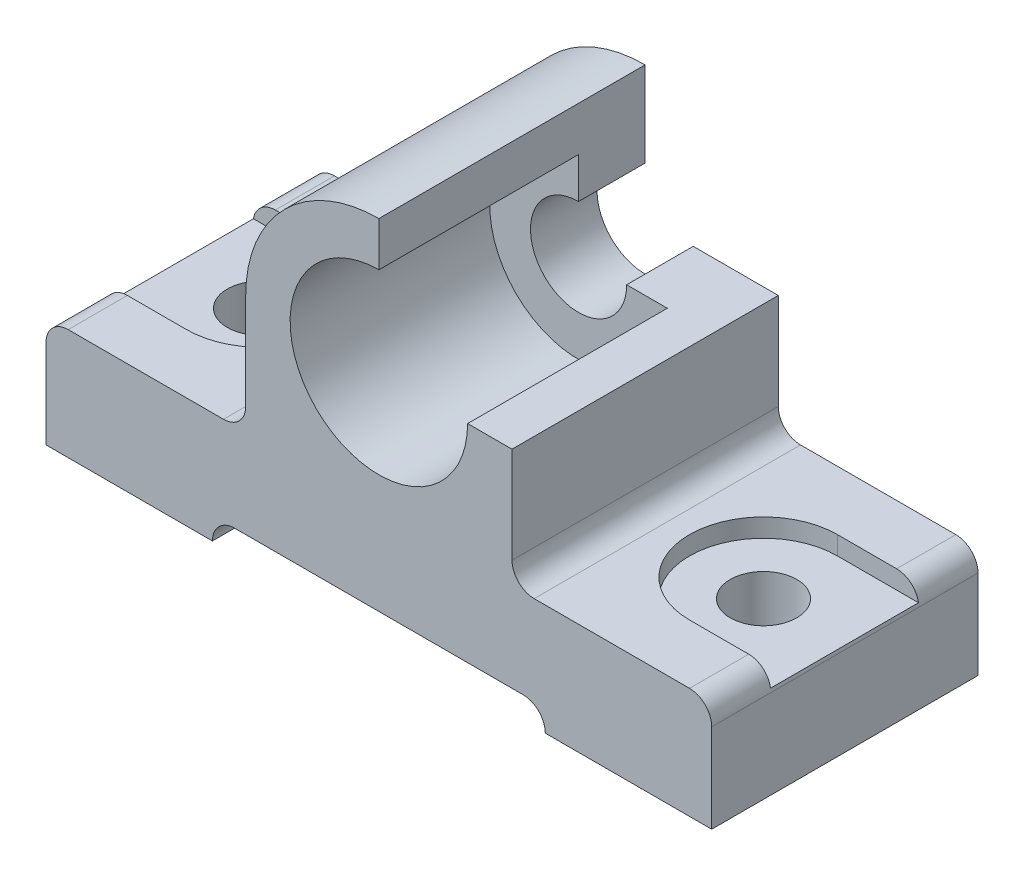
ISO-10303-21;
HEADER;
FILE_DESCRIPTION(('STEP AP214'),'2;1');
FILE_NAME('part.step','',(''),(''),'','','');
FILE_SCHEMA(('AUTOMOTIVE_DESIGN { 1 0 10303 214 1 1 1 1 }'));
ENDSEC;
DATA;
#1=APPLICATION_CONTEXT('core data for automotive mechanical design processes');
#2=APPLICATION_PROTOCOL_DEFINITION('international standard','automotive_design',2000,#1);
#3=PRODUCT_CONTEXT('',#1,'mechanical');
#4=PRODUCT('Part','Part','',(#3));
#5=PRODUCT_RELATED_PRODUCT_CATEGORY('part','',(#4));
#6=PRODUCT_DEFINITION_FORMATION('','',#4);
#7=PRODUCT_DEFINITION_CONTEXT('part definition',#1,'design');
#8=PRODUCT_DEFINITION('design','',#6,#7);
#9=PRODUCT_DEFINITION_SHAPE('','',#8);
#10=(LENGTH_UNIT() NAMED_UNIT(*) SI_UNIT(.MILLI.,.METRE.));
#11=(NAMED_UNIT(*) PLANE_ANGLE_UNIT() SI_UNIT($,.RADIAN.));
#12=(NAMED_UNIT(*) SI_UNIT($,.STERADIAN.) SOLID_ANGLE_UNIT());
#13=UNCERTAINTY_MEASURE_WITH_UNIT(LENGTH_MEASURE(1.E-05),#10,'distance_accuracy_value','');
#14=(GEOMETRIC_REPRESENTATION_CONTEXT(3) GLOBAL_UNCERTAINTY_ASSIGNED_CONTEXT((#13)) GLOBAL_UNIT_ASSIGNED_CONTEXT((#10,
#11,#12)) REPRESENTATION_CONTEXT('',''));
#15=CARTESIAN_POINT('',(0.,0.,0.));
#16=DIRECTION('',(0.,0.,1.));
#17=DIRECTION('',(1.,0.,0.));
#18=AXIS2_PLACEMENT_3D('',#15,#16,#17);
#19=CARTESIAN_POINT('',(0.,0.,-36.));
#20=DIRECTION('',(0.,-1.,0.));
#21=DIRECTION('',(0.,0.,-1.));
#22=AXIS2_PLACEMENT_3D('',#19,#20,#21);
#23=PLANE('',#22);
#24=DIRECTION('',(1.,0.,0.));
#25=VECTOR('',#24,1.);
#26=CARTESIAN_POINT('',(0.,0.,0.));
#27=LINE('',#26,#25);
#28=CARTESIAN_POINT('',(0.,0.,0.));
#29=VERTEX_POINT('',#28);
#30=CARTESIAN_POINT('',(22.5,0.,0.));
#31=VERTEX_POINT('',#30);
#32=EDGE_CURVE('E355',#29,#31,#27,.T.);
#33=ORIENTED_EDGE('',*,*,#32,.F.);
#34=DIRECTION('',(0.,0.,1.));
#35=VECTOR('',#34,1.);
#36=CARTESIAN_POINT('',(0.,0.,-36.));
#37=LINE('',#36,#35);
#38=CARTESIAN_POINT('',(0.,0.,-36.));
#39=VERTEX_POINT('',#38);
#40=EDGE_CURVE('E250',#39,#29,#37,.T.);
#41=ORIENTED_EDGE('',*,*,#40,.F.);
#42=DIRECTION('',(1.,0.,0.));
#43=VECTOR('',#42,1.);
#44=CARTESIAN_POINT('',(0.,0.,-36.));
#45=LINE('',#44,#43);
#46=CARTESIAN_POINT('',(22.5,0.,-36.));
#47=VERTEX_POINT('',#46);
#48=EDGE_CURVE('E382',#39,#47,#45,.T.);
#49=ORIENTED_EDGE('',*,*,#48,.T.);
#50=DIRECTION('',(0.,0.,1.));
#51=VECTOR('',#50,1.);
#52=CARTESIAN_POINT('',(22.5,0.,-36.));
#53=LINE('',#52,#51);
#54=EDGE_CURVE('E262',#47,#31,#53,.T.);
#55=ORIENTED_EDGE('',*,*,#54,.T.);
#56=EDGE_LOOP('',(#33,#41,#49,#55));
#57=FACE_BOUND('',#56,.T.);
#58=CARTESIAN_POINT('',(11.,0.,-18.));
#59=DIRECTION('',(0.,-1.,0.));
#60=DIRECTION('',(0.,0.,-1.));
#61=AXIS2_PLACEMENT_3D('',#58,#59,#60);
#62=CIRCLE('',#61,4.5);
#63=CARTESIAN_POINT('',(11.,0.,-22.5));
#64=VERTEX_POINT('',#63);
#65=EDGE_CURVE('E430',#64,#64,#62,.T.);
#66=ORIENTED_EDGE('',*,*,#65,.F.);
#67=EDGE_LOOP('',(#66));
#68=FACE_BOUND('',#67,.T.);
#69=ADVANCED_FACE('F26',(#57,#68),#23,.T.);
#70=CARTESIAN_POINT('',(11.,12.5,-18.));
#71=DIRECTION('',(0.,1.,0.));
#72=DIRECTION('',(0.,0.,1.));
#73=AXIS2_PLACEMENT_3D('',#70,#71,#72);
#74=PLANE('',#73);
#75=DIRECTION('',(-1.,0.,0.));
#76=VECTOR('',#75,1.);
#77=CARTESIAN_POINT('',(0.,12.5,-8.));
#78=LINE('',#77,#76);
#79=CARTESIAN_POINT('',(11.,12.5,-8.));
#80=VERTEX_POINT('',#79);
#81=CARTESIAN_POINT('',(0.0419601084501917,12.5,-8.));
#82=VERTEX_POINT('',#81);
#83=EDGE_CURVE('E442',#80,#82,#78,.T.);
#84=ORIENTED_EDGE('',*,*,#83,.F.);
#85=CARTESIAN_POINT('',(11.,12.5,-18.));
#86=DIRECTION('',(0.,-1.,0.));
#87=DIRECTION('',(0.,0.,1.));
#88=AXIS2_PLACEMENT_3D('',#85,#86,#87);
#89=CIRCLE('',#88,10.);
#90=CARTESIAN_POINT('',(11.,12.5,-28.));
#91=VERTEX_POINT('',#90);
#92=EDGE_CURVE('E445',#91,#80,#89,.T.);
#93=ORIENTED_EDGE('',*,*,#92,.F.);
#94=DIRECTION('',(1.,0.,0.));
#95=VECTOR('',#94,1.);
#96=CARTESIAN_POINT('',(0.,12.5,-28.));
#97=LINE('',#96,#95);
#98=CARTESIAN_POINT('',(0.0419601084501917,12.5,-28.));
#99=VERTEX_POINT('',#98);
#100=EDGE_CURVE('E447',#99,#91,#97,.T.);
#101=ORIENTED_EDGE('',*,*,#100,.F.);
#102=DIRECTION('',(0.,0.,1.));
#103=VECTOR('',#102,1.);
#104=CARTESIAN_POINT('',(0.0419601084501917,12.5,-36.));
#105=LINE('',#104,#103);
#106=EDGE_CURVE('E326',#82,#99,#105,.F.);
#107=ORIENTED_EDGE('',*,*,#106,.F.);
#108=EDGE_LOOP('',(#84,#93,#101,#107));
#109=FACE_BOUND('',#108,.T.);
#110=CARTESIAN_POINT('',(11.,12.5,-18.));
#111=DIRECTION('',(0.,-1.,0.));
#112=DIRECTION('',(0.,0.,1.));
#113=AXIS2_PLACEMENT_3D('',#110,#111,#112);
#114=CIRCLE('',#113,4.5);
#115=CARTESIAN_POINT('',(11.,12.5,-13.5));
#116=VERTEX_POINT('',#115);
#117=EDGE_CURVE('E232',#116,#116,#114,.T.);
#118=ORIENTED_EDGE('',*,*,#117,.T.);
#119=EDGE_LOOP('',(#118));
#120=FACE_BOUND('',#119,.T.);
#121=ADVANCED_FACE('F506',(#109,#120),#74,.T.);
#122=CARTESIAN_POINT('',(0.,15.,-36.));
#123=DIRECTION('',(0.,1.,0.));
#124=DIRECTION('',(0.,0.,1.));
#125=AXIS2_PLACEMENT_3D('',#122,#123,#124);
#126=PLANE('',#125);
#127=DIRECTION('',(0.,0.,1.));
#128=VECTOR('',#127,1.);
#129=CARTESIAN_POINT('',(3.,15.,-36.));
#130=LINE('',#129,#128);
#131=CARTESIAN_POINT('',(3.,15.,-36.));
#132=VERTEX_POINT('',#131);
#133=CARTESIAN_POINT('',(3.,15.,-28.));
#134=VERTEX_POINT('',#133);
#135=EDGE_CURVE('E290',#132,#134,#130,.T.);
#136=ORIENTED_EDGE('',*,*,#135,.T.);
#137=DIRECTION('',(1.,0.,0.));
#138=VECTOR('',#137,1.);
#139=CARTESIAN_POINT('',(0.,15.,-28.));
#140=LINE('',#139,#138);
#141=CARTESIAN_POINT('',(11.,15.,-28.));
#142=VERTEX_POINT('',#141);
#143=EDGE_CURVE('E439',#134,#142,#140,.T.);
#144=ORIENTED_EDGE('',*,*,#143,.T.);
#145=CARTESIAN_POINT('',(11.,15.,-18.));
#146=DIRECTION('',(0.,-1.,0.));
#147=DIRECTION('',(0.,0.,1.));
#148=AXIS2_PLACEMENT_3D('',#145,#146,#147);
#149=CIRCLE('',#148,10.);
#150=CARTESIAN_POINT('',(11.,15.,-8.));
#151=VERTEX_POINT('',#150);
#152=EDGE_CURVE('E436',#142,#151,#149,.T.);
#153=ORIENTED_EDGE('',*,*,#152,.T.);
#154=DIRECTION('',(-1.,0.,0.));
#155=VECTOR('',#154,1.);
#156=CARTESIAN_POINT('',(0.,15.,-8.));
#157=LINE('',#156,#155);
#158=CARTESIAN_POINT('',(3.,15.,-8.));
#159=VERTEX_POINT('',#158);
#160=EDGE_CURVE('E433',#151,#159,#157,.T.);
#161=ORIENTED_EDGE('',*,*,#160,.T.);
#162=CARTESIAN_POINT('',(3.,15.,0.));
#163=VERTEX_POINT('',#162);
#164=EDGE_CURVE('E289',#159,#163,#130,.T.);
#165=ORIENTED_EDGE('',*,*,#164,.T.);
#166=DIRECTION('',(-1.,0.,0.));
#167=VECTOR('',#166,1.);
#168=CARTESIAN_POINT('',(0.,15.,0.));
#169=LINE('',#168,#167);
#170=CARTESIAN_POINT('',(24.,15.,0.));
#171=VERTEX_POINT('',#170);
#172=EDGE_CURVE('E377',#171,#163,#169,.T.);
#173=ORIENTED_EDGE('',*,*,#172,.F.);
#174=DIRECTION('',(0.,0.,1.));
#175=VECTOR('',#174,1.);
#176=CARTESIAN_POINT('',(24.,15.,-36.));
#177=LINE('',#176,#175);
#178=CARTESIAN_POINT('',(24.,15.,-36.));
#179=VERTEX_POINT('',#178);
#180=EDGE_CURVE('E293',#171,#179,#177,.F.);
#181=ORIENTED_EDGE('',*,*,#180,.T.);
#182=DIRECTION('',(-1.,0.,0.));
#183=VECTOR('',#182,1.);
#184=CARTESIAN_POINT('',(0.,15.,-36.));
#185=LINE('',#184,#183);
#186=EDGE_CURVE('E241',#179,#132,#185,.T.);
#187=ORIENTED_EDGE('',*,*,#186,.T.);
#188=EDGE_LOOP('',(#136,#144,#153,#161,#165,#173,#181,#187));
#189=FACE_BOUND('',#188,.T.);
#190=ADVANCED_FACE('F512',(#189),#126,.T.);
#191=CARTESIAN_POINT('',(3.,12.,-36.));
#192=DIRECTION('',(0.,0.,1.));
#193=DIRECTION('',(1.,0.,0.));
#194=AXIS2_PLACEMENT_3D('',#191,#192,#193);
#195=CYLINDRICAL_SURFACE('',#194,3.);
#196=ORIENTED_EDGE('',*,*,#106,.T.);
#197=CARTESIAN_POINT('',(3.,12.,-28.));
#198=DIRECTION('',(0.,0.,1.));
#199=DIRECTION('',(1.,0.,0.));
#200=AXIS2_PLACEMENT_3D('',#197,#198,#199);
#201=CIRCLE('',#200,3.);
#202=EDGE_CURVE('E332',#99,#134,#201,.F.);
#203=ORIENTED_EDGE('',*,*,#202,.T.);
#204=ORIENTED_EDGE('',*,*,#135,.F.);
#205=CARTESIAN_POINT('',(3.,12.,-36.));
#206=DIRECTION('',(0.,0.,1.));
#207=DIRECTION('',(1.,0.,0.));
#208=AXIS2_PLACEMENT_3D('',#205,#206,#207);
#209=CIRCLE('',#208,3.);
#210=CARTESIAN_POINT('',(0.,12.,-36.));
#211=VERTEX_POINT('',#210);
#212=EDGE_CURVE('E280',#211,#132,#209,.F.);
#213=ORIENTED_EDGE('',*,*,#212,.F.);
#214=DIRECTION('',(0.,0.,1.));
#215=VECTOR('',#214,1.);
#216=CARTESIAN_POINT('',(0.,12.,-36.));
#217=LINE('',#216,#215);
#218=CARTESIAN_POINT('',(0.,12.,0.));
#219=VERTEX_POINT('',#218);
#220=EDGE_CURVE('E295',#219,#211,#217,.F.);
#221=ORIENTED_EDGE('',*,*,#220,.F.);
#222=CARTESIAN_POINT('',(3.,12.,0.));
#223=DIRECTION('',(0.,0.,1.));
#224=DIRECTION('',(1.,0.,0.));
#225=AXIS2_PLACEMENT_3D('',#222,#223,#224);
#226=CIRCLE('',#225,3.);
#227=EDGE_CURVE('E269',#163,#219,#226,.T.);
#228=ORIENTED_EDGE('',*,*,#227,.F.);
#229=ORIENTED_EDGE('',*,*,#164,.F.);
#230=CARTESIAN_POINT('',(3.,12.,-8.));
#231=DIRECTION('',(0.,0.,-1.));
#232=DIRECTION('',(-1.,0.,0.));
#233=AXIS2_PLACEMENT_3D('',#230,#231,#232);
#234=CIRCLE('',#233,3.);
#235=EDGE_CURVE('E329',#159,#82,#234,.F.);
#236=ORIENTED_EDGE('',*,*,#235,.T.);
#237=EDGE_LOOP('',(#196,#203,#204,#213,#221,#228,#229,#236));
#238=FACE_BOUND('',#237,.T.);
#239=ADVANCED_FACE('F541',(#238),#195,.T.);
#240=CARTESIAN_POINT('',(0.,0.,-36.));
#241=DIRECTION('',(-1.,0.,0.));
#242=DIRECTION('',(0.,0.,1.));
#243=AXIS2_PLACEMENT_3D('',#240,#241,#242);
#244=PLANE('',#243);
#245=DIRECTION('',(0.,-1.,0.));
#246=VECTOR('',#245,1.);
#247=CARTESIAN_POINT('',(0.,0.,0.));
#248=LINE('',#247,#246);
#249=EDGE_CURVE('E353',#219,#29,#248,.T.);
#250=ORIENTED_EDGE('',*,*,#249,.F.);
#251=ORIENTED_EDGE('',*,*,#220,.T.);
#252=DIRECTION('',(0.,-1.,0.));
#253=VECTOR('',#252,1.);
#254=CARTESIAN_POINT('',(0.,0.,-36.));
#255=LINE('',#254,#253);
#256=EDGE_CURVE('E380',#211,#39,#255,.T.);
#257=ORIENTED_EDGE('',*,*,#256,.T.);
#258=ORIENTED_EDGE('',*,*,#40,.T.);
#259=EDGE_LOOP('',(#250,#251,#257,#258));
#260=FACE_BOUND('',#259,.T.);
#261=ADVANCED_FACE('F28',(#260),#244,.T.);
#262=CARTESIAN_POINT('',(27.,15.,-36.));
#263=DIRECTION('',(-1.,0.,0.));
#264=DIRECTION('',(0.,0.,1.));
#265=AXIS2_PLACEMENT_3D('',#262,#263,#264);
#266=PLANE('',#265);
#267=DIRECTION('',(0.,-1.,0.));
#268=VECTOR('',#267,1.);
#269=CARTESIAN_POINT('',(27.,15.,-36.));
#270=LINE('',#269,#268);
#271=CARTESIAN_POINT('',(27.,31.,-36.));
#272=VERTEX_POINT('',#271);
#273=CARTESIAN_POINT('',(27.,18.,-36.));
#274=VERTEX_POINT('',#273);
#275=EDGE_CURVE('E238',#272,#274,#270,.T.);
#276=ORIENTED_EDGE('',*,*,#275,.T.);
#277=DIRECTION('',(0.,0.,1.));
#278=VECTOR('',#277,1.);
#279=CARTESIAN_POINT('',(27.,18.,0.));
#280=LINE('',#279,#278);
#281=CARTESIAN_POINT('',(27.,18.,0.));
#282=VERTEX_POINT('',#281);
#283=EDGE_CURVE('E286',#274,#282,#280,.T.);
#284=ORIENTED_EDGE('',*,*,#283,.T.);
#285=DIRECTION('',(0.,-1.,0.));
#286=VECTOR('',#285,1.);
#287=CARTESIAN_POINT('',(27.,15.,0.));
#288=LINE('',#287,#286);
#289=CARTESIAN_POINT('',(27.,31.,0.));
#290=VERTEX_POINT('',#289);
#291=EDGE_CURVE('E374',#290,#282,#288,.T.);
#292=ORIENTED_EDGE('',*,*,#291,.F.);
#293=DIRECTION('',(0.,0.,1.));
#294=VECTOR('',#293,1.);
#295=CARTESIAN_POINT('',(27.,31.,-36.));
#296=LINE('',#295,#294);
#297=EDGE_CURVE('E251',#272,#290,#296,.T.);
#298=ORIENTED_EDGE('',*,*,#297,.F.);
#299=EDGE_LOOP('',(#276,#284,#292,#298));
#300=FACE_BOUND('',#299,.T.);
#301=ADVANCED_FACE('F535',(#300),#266,.T.);
#302=CARTESIAN_POINT('',(45.,31.,-36.));
#303=DIRECTION('',(0.,0.,1.));
#304=DIRECTION('',(1.,0.,0.));
#305=AXIS2_PLACEMENT_3D('',#302,#303,#304);
#306=CYLINDRICAL_SURFACE('',#305,18.);
#307=DIRECTION('',(0.,0.,1.));
#308=VECTOR('',#307,1.);
#309=CARTESIAN_POINT('',(45.,49.,-36.));
#310=LINE('',#309,#308);
#311=CARTESIAN_POINT('',(45.,49.,-36.));
#312=VERTEX_POINT('',#311);
#313=CARTESIAN_POINT('',(45.,49.,0.));
#314=VERTEX_POINT('',#313);
#315=EDGE_CURVE('E217',#312,#314,#310,.T.);
#316=ORIENTED_EDGE('',*,*,#315,.F.);
#317=CARTESIAN_POINT('',(45.,31.,-36.));
#318=DIRECTION('',(0.,0.,1.));
#319=DIRECTION('',(1.,0.,0.));
#320=AXIS2_PLACEMENT_3D('',#317,#318,#319);
#321=CIRCLE('',#320,18.);
#322=EDGE_CURVE('E229',#312,#272,#321,.T.);
#323=ORIENTED_EDGE('',*,*,#322,.T.);
#324=ORIENTED_EDGE('',*,*,#297,.T.);
#325=CARTESIAN_POINT('',(45.,31.,0.));
#326=DIRECTION('',(0.,0.,1.));
#327=DIRECTION('',(1.,0.,0.));
#328=AXIS2_PLACEMENT_3D('',#325,#326,#327);
#329=CIRCLE('',#328,18.);
#330=EDGE_CURVE('E231',#314,#290,#329,.T.);
#331=ORIENTED_EDGE('',*,*,#330,.F.);
#332=EDGE_LOOP('',(#316,#323,#324,#331));
#333=FACE_BOUND('',#332,.T.);
#334=ADVANCED_FACE('F227',(#333),#306,.T.);
#335=CARTESIAN_POINT('',(63.,31.,-36.));
#336=DIRECTION('',(1.,0.,0.));
#337=DIRECTION('',(0.,0.,-1.));
#338=AXIS2_PLACEMENT_3D('',#335,#336,#337);
#339=PLANE('',#338);
#340=DIRECTION('',(0.,1.,0.));
#341=VECTOR('',#340,1.);
#342=CARTESIAN_POINT('',(63.,31.,0.));
#343=LINE('',#342,#341);
#344=CARTESIAN_POINT('',(63.,18.,0.));
#345=VERTEX_POINT('',#344);
#346=CARTESIAN_POINT('',(63.,31.,0.));
#347=VERTEX_POINT('',#346);
#348=EDGE_CURVE('E370',#345,#347,#343,.T.);
#349=ORIENTED_EDGE('',*,*,#348,.F.);
#350=DIRECTION('',(0.,0.,1.));
#351=VECTOR('',#350,1.);
#352=CARTESIAN_POINT('',(63.,18.,-36.));
#353=LINE('',#352,#351);
#354=CARTESIAN_POINT('',(63.,18.,-36.));
#355=VERTEX_POINT('',#354);
#356=EDGE_CURVE('E284',#345,#355,#353,.F.);
#357=ORIENTED_EDGE('',*,*,#356,.T.);
#358=DIRECTION('',(0.,1.,0.));
#359=VECTOR('',#358,1.);
#360=CARTESIAN_POINT('',(63.,31.,-36.));
#361=LINE('',#360,#359);
#362=CARTESIAN_POINT('',(63.,31.,-36.));
#363=VERTEX_POINT('',#362);
#364=EDGE_CURVE('E239',#355,#363,#361,.T.);
#365=ORIENTED_EDGE('',*,*,#364,.T.);
#366=DIRECTION('',(0.,0.,1.));
#367=VECTOR('',#366,1.);
#368=CARTESIAN_POINT('',(63.,31.,-36.));
#369=LINE('',#368,#367);
#370=EDGE_CURVE('E254',#363,#347,#369,.T.);
#371=ORIENTED_EDGE('',*,*,#370,.T.);
#372=EDGE_LOOP('',(#349,#357,#365,#371));
#373=FACE_BOUND('',#372,.T.);
#374=ADVANCED_FACE('F412',(#373),#339,.T.);
#375=CARTESIAN_POINT('',(63.,15.,-36.));
#376=DIRECTION('',(0.,1.,0.));
#377=DIRECTION('',(0.,0.,1.));
#378=AXIS2_PLACEMENT_3D('',#375,#376,#377);
#379=PLANE('',#378);
#380=DIRECTION('',(1.,0.,0.));
#381=VECTOR('',#380,1.);
#382=CARTESIAN_POINT('',(90.,15.,-8.));
#383=LINE('',#382,#381);
#384=CARTESIAN_POINT('',(79.,15.,-8.));
#385=VERTEX_POINT('',#384);
#386=CARTESIAN_POINT('',(87.,15.,-8.));
#387=VERTEX_POINT('',#386);
#388=EDGE_CURVE('E464',#385,#387,#383,.T.);
#389=ORIENTED_EDGE('',*,*,#388,.F.);
#390=CARTESIAN_POINT('',(79.,15.,-18.));
#391=DIRECTION('',(0.,1.,0.));
#392=DIRECTION('',(0.,0.,1.));
#393=AXIS2_PLACEMENT_3D('',#390,#391,#392);
#394=CIRCLE('',#393,10.);
#395=CARTESIAN_POINT('',(79.,15.,-28.));
#396=VERTEX_POINT('',#395);
#397=EDGE_CURVE('E461',#396,#385,#394,.T.);
#398=ORIENTED_EDGE('',*,*,#397,.F.);
#399=DIRECTION('',(-1.,0.,0.));
#400=VECTOR('',#399,1.);
#401=CARTESIAN_POINT('',(90.,15.,-28.));
#402=LINE('',#401,#400);
#403=CARTESIAN_POINT('',(87.,15.,-28.));
#404=VERTEX_POINT('',#403);
#405=EDGE_CURVE('E457',#404,#396,#402,.T.);
#406=ORIENTED_EDGE('',*,*,#405,.F.);
#407=DIRECTION('',(0.,0.,1.));
#408=VECTOR('',#407,1.);
#409=CARTESIAN_POINT('',(87.,15.,-36.));
#410=LINE('',#409,#408);
#411=CARTESIAN_POINT('',(87.,15.,-36.));
#412=VERTEX_POINT('',#411);
#413=EDGE_CURVE('E276',#404,#412,#410,.F.);
#414=ORIENTED_EDGE('',*,*,#413,.T.);
#415=DIRECTION('',(-1.,0.,0.));
#416=VECTOR('',#415,1.);
#417=CARTESIAN_POINT('',(63.,15.,-36.));
#418=LINE('',#417,#416);
#419=CARTESIAN_POINT('',(66.,15.,-36.));
#420=VERTEX_POINT('',#419);
#421=EDGE_CURVE('E244',#412,#420,#418,.T.);
#422=ORIENTED_EDGE('',*,*,#421,.T.);
#423=DIRECTION('',(0.,0.,1.));
#424=VECTOR('',#423,1.);
#425=CARTESIAN_POINT('',(66.,15.,0.));
#426=LINE('',#425,#424);
#427=CARTESIAN_POINT('',(66.,15.,0.));
#428=VERTEX_POINT('',#427);
#429=EDGE_CURVE('E273',#420,#428,#426,.T.);
#430=ORIENTED_EDGE('',*,*,#429,.T.);
#431=DIRECTION('',(-1.,0.,0.));
#432=VECTOR('',#431,1.);
#433=CARTESIAN_POINT('',(63.,15.,0.));
#434=LINE('',#433,#432);
#435=CARTESIAN_POINT('',(87.,15.,0.));
#436=VERTEX_POINT('',#435);
#437=EDGE_CURVE('E367',#436,#428,#434,.T.);
#438=ORIENTED_EDGE('',*,*,#437,.F.);
#439=EDGE_CURVE('E277',#436,#387,#410,.F.);
#440=ORIENTED_EDGE('',*,*,#439,.T.);
#441=EDGE_LOOP('',(#389,#398,#406,#414,#422,#430,#438,#440));
#442=FACE_BOUND('',#441,.T.);
#443=ADVANCED_FACE('F398',(#442),#379,.T.);
#444=CARTESIAN_POINT('',(90.,15.,-36.));
#445=DIRECTION('',(1.,0.,0.));
#446=DIRECTION('',(0.,0.,-1.));
#447=AXIS2_PLACEMENT_3D('',#444,#445,#446);
#448=PLANE('',#447);
#449=DIRECTION('',(0.,1.,0.));
#450=VECTOR('',#449,1.);
#451=CARTESIAN_POINT('',(90.,15.,-36.));
#452=LINE('',#451,#450);
#453=CARTESIAN_POINT('',(90.,0.,-36.));
#454=VERTEX_POINT('',#453);
#455=CARTESIAN_POINT('',(90.,12.,-36.));
#456=VERTEX_POINT('',#455);
#457=EDGE_CURVE('E391',#454,#456,#452,.T.);
#458=ORIENTED_EDGE('',*,*,#457,.T.);
#459=DIRECTION('',(0.,0.,1.));
#460=VECTOR('',#459,1.);
#461=CARTESIAN_POINT('',(90.,12.,-36.));
#462=LINE('',#461,#460);
#463=CARTESIAN_POINT('',(90.,12.,0.));
#464=VERTEX_POINT('',#463);
#465=EDGE_CURVE('E253',#456,#464,#462,.T.);
#466=ORIENTED_EDGE('',*,*,#465,.T.);
#467=DIRECTION('',(0.,1.,0.));
#468=VECTOR('',#467,1.);
#469=CARTESIAN_POINT('',(90.,15.,0.));
#470=LINE('',#469,#468);
#471=CARTESIAN_POINT('',(90.,0.,0.));
#472=VERTEX_POINT('',#471);
#473=EDGE_CURVE('E364',#472,#464,#470,.T.);
#474=ORIENTED_EDGE('',*,*,#473,.F.);
#475=DIRECTION('',(0.,0.,1.));
#476=VECTOR('',#475,1.);
#477=CARTESIAN_POINT('',(90.,0.,-36.));
#478=LINE('',#477,#476);
#479=EDGE_CURVE('E257',#454,#472,#478,.T.);
#480=ORIENTED_EDGE('',*,*,#479,.F.);
#481=EDGE_LOOP('',(#458,#466,#474,#480));
#482=FACE_BOUND('',#481,.T.);
#483=ADVANCED_FACE('F524',(#482),#448,.T.);
#484=CARTESIAN_POINT('',(90.,0.,-36.));
#485=DIRECTION('',(0.,-1.,0.));
#486=DIRECTION('',(1.,0.,0.));
#487=AXIS2_PLACEMENT_3D('',#484,#485,#486);
#488=PLANE('',#487);
#489=CARTESIAN_POINT('',(79.,0.,-18.));
#490=DIRECTION('',(0.,-1.,0.));
#491=DIRECTION('',(1.,0.,0.));
#492=AXIS2_PLACEMENT_3D('',#489,#490,#491);
#493=CIRCLE('',#492,4.5);
#494=CARTESIAN_POINT('',(83.5,0.,-18.));
#495=VERTEX_POINT('',#494);
#496=EDGE_CURVE('E452',#495,#495,#493,.F.);
#497=ORIENTED_EDGE('',*,*,#496,.T.);
#498=EDGE_LOOP('',(#497));
#499=FACE_BOUND('',#498,.T.);
#500=DIRECTION('',(1.,0.,0.));
#501=VECTOR('',#500,1.);
#502=CARTESIAN_POINT('',(90.,0.,0.));
#503=LINE('',#502,#501);
#504=CARTESIAN_POINT('',(67.5,0.,0.));
#505=VERTEX_POINT('',#504);
#506=EDGE_CURVE('E361',#505,#472,#503,.T.);
#507=ORIENTED_EDGE('',*,*,#506,.F.);
#508=DIRECTION('',(0.,0.,1.));
#509=VECTOR('',#508,1.);
#510=CARTESIAN_POINT('',(67.5,0.,-36.));
#511=LINE('',#510,#509);
#512=CARTESIAN_POINT('',(67.5,0.,-36.));
#513=VERTEX_POINT('',#512);
#514=EDGE_CURVE('E259',#513,#505,#511,.T.);
#515=ORIENTED_EDGE('',*,*,#514,.F.);
#516=DIRECTION('',(1.,0.,0.));
#517=VECTOR('',#516,1.);
#518=CARTESIAN_POINT('',(90.,0.,-36.));
#519=LINE('',#518,#517);
#520=EDGE_CURVE('E388',#513,#454,#519,.T.);
#521=ORIENTED_EDGE('',*,*,#520,.T.);
#522=ORIENTED_EDGE('',*,*,#479,.T.);
#523=EDGE_LOOP('',(#507,#515,#521,#522));
#524=FACE_BOUND('',#523,.T.);
#525=ADVANCED_FACE('F521',(#499,#524),#488,.T.);
#526=CARTESIAN_POINT('',(22.5,3.,-36.));
#527=DIRECTION('',(0.,-1.,0.));
#528=DIRECTION('',(0.,0.,-1.));
#529=AXIS2_PLACEMENT_3D('',#526,#527,#528);
#530=PLANE('',#529);
#531=DIRECTION('',(1.,0.,0.));
#532=VECTOR('',#531,1.);
#533=CARTESIAN_POINT('',(22.5,3.,0.));
#534=LINE('',#533,#532);
#535=CARTESIAN_POINT('',(25.5,3.,0.));
#536=VERTEX_POINT('',#535);
#537=CARTESIAN_POINT('',(64.5,3.,0.));
#538=VERTEX_POINT('',#537);
#539=EDGE_CURVE('E358',#536,#538,#534,.T.);
#540=ORIENTED_EDGE('',*,*,#539,.F.);
#541=DIRECTION('',(0.,0.,1.));
#542=VECTOR('',#541,1.);
#543=CARTESIAN_POINT('',(25.5,3.,-36.));
#544=LINE('',#543,#542);
#545=CARTESIAN_POINT('',(25.5,3.,-36.));
#546=VERTEX_POINT('',#545);
#547=EDGE_CURVE('E300',#536,#546,#544,.F.);
#548=ORIENTED_EDGE('',*,*,#547,.T.);
#549=DIRECTION('',(1.,0.,0.));
#550=VECTOR('',#549,1.);
#551=CARTESIAN_POINT('',(22.5,3.,-36.));
#552=LINE('',#551,#550);
#553=CARTESIAN_POINT('',(64.5,3.,-36.));
#554=VERTEX_POINT('',#553);
#555=EDGE_CURVE('E385',#546,#554,#552,.T.);
#556=ORIENTED_EDGE('',*,*,#555,.T.);
#557=DIRECTION('',(0.,0.,1.));
#558=VECTOR('',#557,1.);
#559=CARTESIAN_POINT('',(64.5,3.,0.));
#560=LINE('',#559,#558);
#561=EDGE_CURVE('E297',#554,#538,#560,.T.);
#562=ORIENTED_EDGE('',*,*,#561,.T.);
#563=EDGE_LOOP('',(#540,#548,#556,#562));
#564=FACE_BOUND('',#563,.T.);
#565=ADVANCED_FACE('F518',(#564),#530,.T.);
#566=CARTESIAN_POINT('',(45.,31.,-36.));
#567=DIRECTION('',(0.,0.,1.));
#568=DIRECTION('',(1.,0.,0.));
#569=AXIS2_PLACEMENT_3D('',#566,#567,#568);
#570=PLANE('',#569);
#571=ORIENTED_EDGE('',*,*,#322,.F.);
#572=DIRECTION('',(0.,-1.,0.));
#573=VECTOR('',#572,1.);
#574=CARTESIAN_POINT('',(45.,53.1343612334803,-36.));
#575=LINE('',#574,#573);
#576=CARTESIAN_POINT('',(45.,37.5,-36.));
#577=VERTEX_POINT('',#576);
#578=EDGE_CURVE('E214',#312,#577,#575,.T.);
#579=ORIENTED_EDGE('',*,*,#578,.T.);
#580=CARTESIAN_POINT('',(45.,31.,-36.));
#581=DIRECTION('',(0.,0.,1.));
#582=DIRECTION('',(1.,0.,0.));
#583=AXIS2_PLACEMENT_3D('',#580,#581,#582);
#584=CIRCLE('',#583,6.5);
#585=CARTESIAN_POINT('',(51.5,31.,-36.));
#586=VERTEX_POINT('',#585);
#587=EDGE_CURVE('E337',#577,#586,#584,.T.);
#588=ORIENTED_EDGE('',*,*,#587,.T.);
#589=DIRECTION('',(1.,0.,0.));
#590=VECTOR('',#589,1.);
#591=CARTESIAN_POINT('',(45.,31.,-36.));
#592=LINE('',#591,#590);
#593=EDGE_CURVE('E48',#586,#363,#592,.T.);
#594=ORIENTED_EDGE('',*,*,#593,.T.);
#595=ORIENTED_EDGE('',*,*,#364,.F.);
#596=CARTESIAN_POINT('',(66.,18.,-36.));
#597=DIRECTION('',(0.,0.,1.));
#598=DIRECTION('',(1.,0.,0.));
#599=AXIS2_PLACEMENT_3D('',#596,#597,#598);
#600=CIRCLE('',#599,3.);
#601=EDGE_CURVE('E304',#355,#420,#600,.T.);
#602=ORIENTED_EDGE('',*,*,#601,.T.);
#603=ORIENTED_EDGE('',*,*,#421,.F.);
#604=CARTESIAN_POINT('',(87.,12.,-36.));
#605=DIRECTION('',(0.,0.,1.));
#606=DIRECTION('',(1.,0.,0.));
#607=AXIS2_PLACEMENT_3D('',#604,#605,#606);
#608=CIRCLE('',#607,3.);
#609=EDGE_CURVE('E282',#412,#456,#608,.F.);
#610=ORIENTED_EDGE('',*,*,#609,.T.);
#611=ORIENTED_EDGE('',*,*,#457,.F.);
#612=ORIENTED_EDGE('',*,*,#520,.F.);
#613=CARTESIAN_POINT('',(64.5,0.,-36.));
#614=DIRECTION('',(0.,0.,1.));
#615=DIRECTION('',(1.,0.,0.));
#616=AXIS2_PLACEMENT_3D('',#613,#614,#615);
#617=CIRCLE('',#616,3.);
#618=EDGE_CURVE('E316',#513,#554,#617,.T.);
#619=ORIENTED_EDGE('',*,*,#618,.T.);
#620=ORIENTED_EDGE('',*,*,#555,.F.);
#621=CARTESIAN_POINT('',(25.5,0.,-36.));
#622=DIRECTION('',(0.,0.,1.));
#623=DIRECTION('',(1.,0.,0.));
#624=AXIS2_PLACEMENT_3D('',#621,#622,#623);
#625=CIRCLE('',#624,3.);
#626=EDGE_CURVE('E312',#546,#47,#625,.T.);
#627=ORIENTED_EDGE('',*,*,#626,.T.);
#628=ORIENTED_EDGE('',*,*,#48,.F.);
#629=ORIENTED_EDGE('',*,*,#256,.F.);
#630=ORIENTED_EDGE('',*,*,#212,.T.);
#631=ORIENTED_EDGE('',*,*,#186,.F.);
#632=CARTESIAN_POINT('',(24.,18.,-36.));
#633=DIRECTION('',(0.,0.,1.));
#634=DIRECTION('',(1.,0.,0.));
#635=AXIS2_PLACEMENT_3D('',#632,#633,#634);
#636=CIRCLE('',#635,3.);
#637=EDGE_CURVE('E308',#179,#274,#636,.T.);
#638=ORIENTED_EDGE('',*,*,#637,.T.);
#639=ORIENTED_EDGE('',*,*,#275,.F.);
#640=EDGE_LOOP('',(#571,#579,#588,#594,#595,#602,#603,#610,#611,#612,#619,#620,#627,#628,#629,
#630,#631,#638,#639));
#641=FACE_BOUND('',#640,.T.);
#642=ADVANCED_FACE('F236',(#641),#570,.F.);
#643=CARTESIAN_POINT('',(45.,31.,0.));
#644=DIRECTION('',(0.,0.,1.));
#645=DIRECTION('',(1.,0.,0.));
#646=AXIS2_PLACEMENT_3D('',#643,#644,#645);
#647=PLANE('',#646);
#648=DIRECTION('',(0.,-1.,0.));
#649=VECTOR('',#648,1.);
#650=CARTESIAN_POINT('',(45.,53.1343612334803,0.));
#651=LINE('',#650,#649);
#652=CARTESIAN_POINT('',(45.,43.,0.));
#653=VERTEX_POINT('',#652);
#654=EDGE_CURVE('E417',#314,#653,#651,.T.);
#655=ORIENTED_EDGE('',*,*,#654,.F.);
#656=ORIENTED_EDGE('',*,*,#330,.T.);
#657=ORIENTED_EDGE('',*,*,#291,.T.);
#658=CARTESIAN_POINT('',(24.,18.,0.));
#659=DIRECTION('',(0.,0.,1.));
#660=DIRECTION('',(1.,0.,0.));
#661=AXIS2_PLACEMENT_3D('',#658,#659,#660);
#662=CIRCLE('',#661,3.);
#663=EDGE_CURVE('E306',#282,#171,#662,.F.);
#664=ORIENTED_EDGE('',*,*,#663,.T.);
#665=ORIENTED_EDGE('',*,*,#172,.T.);
#666=ORIENTED_EDGE('',*,*,#227,.T.);
#667=ORIENTED_EDGE('',*,*,#249,.T.);
#668=ORIENTED_EDGE('',*,*,#32,.T.);
#669=CARTESIAN_POINT('',(25.5,0.,0.));
#670=DIRECTION('',(0.,0.,1.));
#671=DIRECTION('',(1.,0.,0.));
#672=AXIS2_PLACEMENT_3D('',#669,#670,#671);
#673=CIRCLE('',#672,3.);
#674=EDGE_CURVE('E310',#31,#536,#673,.F.);
#675=ORIENTED_EDGE('',*,*,#674,.T.);
#676=ORIENTED_EDGE('',*,*,#539,.T.);
#677=CARTESIAN_POINT('',(64.5,0.,0.));
#678=DIRECTION('',(0.,0.,1.));
#679=DIRECTION('',(1.,0.,0.));
#680=AXIS2_PLACEMENT_3D('',#677,#678,#679);
#681=CIRCLE('',#680,3.);
#682=EDGE_CURVE('E314',#538,#505,#681,.F.);
#683=ORIENTED_EDGE('',*,*,#682,.T.);
#684=ORIENTED_EDGE('',*,*,#506,.T.);
#685=ORIENTED_EDGE('',*,*,#473,.T.);
#686=CARTESIAN_POINT('',(87.,12.,0.));
#687=DIRECTION('',(0.,0.,1.));
#688=DIRECTION('',(1.,0.,0.));
#689=AXIS2_PLACEMENT_3D('',#686,#687,#688);
#690=CIRCLE('',#689,3.);
#691=EDGE_CURVE('E271',#464,#436,#690,.T.);
#692=ORIENTED_EDGE('',*,*,#691,.T.);
#693=ORIENTED_EDGE('',*,*,#437,.T.);
#694=CARTESIAN_POINT('',(66.,18.,0.));
#695=DIRECTION('',(0.,0.,1.));
#696=DIRECTION('',(1.,0.,0.));
#697=AXIS2_PLACEMENT_3D('',#694,#695,#696);
#698=CIRCLE('',#697,3.);
#699=EDGE_CURVE('E302',#428,#345,#698,.F.);
#700=ORIENTED_EDGE('',*,*,#699,.T.);
#701=ORIENTED_EDGE('',*,*,#348,.T.);
#702=DIRECTION('',(1.,0.,0.));
#703=VECTOR('',#702,1.);
#704=CARTESIAN_POINT('',(45.,31.,0.));
#705=LINE('',#704,#703);
#706=CARTESIAN_POINT('',(57.,31.,0.));
#707=VERTEX_POINT('',#706);
#708=EDGE_CURVE('E223',#707,#347,#705,.T.);
#709=ORIENTED_EDGE('',*,*,#708,.F.);
#710=CARTESIAN_POINT('',(45.,31.,0.));
#711=DIRECTION('',(0.,0.,1.));
#712=DIRECTION('',(1.,0.,0.));
#713=AXIS2_PLACEMENT_3D('',#710,#711,#712);
#714=CIRCLE('',#713,12.);
#715=EDGE_CURVE('E342',#653,#707,#714,.T.);
#716=ORIENTED_EDGE('',*,*,#715,.F.);
#717=EDGE_LOOP('',(#655,#656,#657,#664,#665,#666,#667,#668,#675,#676,#683,#684,#685,#692,#693,
#700,#701,#709,#716));
#718=FACE_BOUND('',#717,.T.);
#719=ADVANCED_FACE('F409',(#718),#647,.T.);
#720=CARTESIAN_POINT('',(45.,31.,-27.));
#721=DIRECTION('',(0.,0.,1.));
#722=DIRECTION('',(1.,0.,0.));
#723=AXIS2_PLACEMENT_3D('',#720,#721,#722);
#724=CYLINDRICAL_SURFACE('',#723,12.);
#725=CARTESIAN_POINT('',(45.,31.,-27.));
#726=DIRECTION('',(0.,0.,1.));
#727=DIRECTION('',(1.,0.,0.));
#728=AXIS2_PLACEMENT_3D('',#725,#726,#727);
#729=CIRCLE('',#728,12.);
#730=CARTESIAN_POINT('',(45.,43.,-27.));
#731=VERTEX_POINT('',#730);
#732=CARTESIAN_POINT('',(57.,31.,-27.));
#733=VERTEX_POINT('',#732);
#734=EDGE_CURVE('E345',#731,#733,#729,.T.);
#735=ORIENTED_EDGE('',*,*,#734,.F.);
#736=DIRECTION('',(0.,0.,1.));
#737=VECTOR('',#736,1.);
#738=CARTESIAN_POINT('',(45.,43.,-27.));
#739=LINE('',#738,#737);
#740=EDGE_CURVE('E233',#731,#653,#739,.T.);
#741=ORIENTED_EDGE('',*,*,#740,.T.);
#742=ORIENTED_EDGE('',*,*,#715,.T.);
#743=DIRECTION('',(0.,0.,1.));
#744=VECTOR('',#743,1.);
#745=CARTESIAN_POINT('',(57.,31.,-27.));
#746=LINE('',#745,#744);
#747=EDGE_CURVE('E415',#707,#733,#746,.F.);
#748=ORIENTED_EDGE('',*,*,#747,.T.);
#749=EDGE_LOOP('',(#735,#741,#742,#748));
#750=FACE_BOUND('',#749,.T.);
#751=ADVANCED_FACE('F547',(#750),#724,.F.);
#752=CARTESIAN_POINT('',(45.,31.,-27.));
#753=DIRECTION('',(0.,0.,1.));
#754=DIRECTION('',(1.,0.,0.));
#755=AXIS2_PLACEMENT_3D('',#752,#753,#754);
#756=PLANE('',#755);
#757=DIRECTION('',(0.,-1.,0.));
#758=VECTOR('',#757,1.);
#759=CARTESIAN_POINT('',(45.,31.,-27.));
#760=LINE('',#759,#758);
#761=CARTESIAN_POINT('',(45.,37.5,-27.));
#762=VERTEX_POINT('',#761);
#763=EDGE_CURVE('E41',#731,#762,#760,.T.);
#764=ORIENTED_EDGE('',*,*,#763,.F.);
#765=ORIENTED_EDGE('',*,*,#734,.T.);
#766=DIRECTION('',(1.,0.,0.));
#767=VECTOR('',#766,1.);
#768=CARTESIAN_POINT('',(45.,31.,-27.));
#769=LINE('',#768,#767);
#770=CARTESIAN_POINT('',(51.5,31.,-27.));
#771=VERTEX_POINT('',#770);
#772=EDGE_CURVE('E422',#771,#733,#769,.T.);
#773=ORIENTED_EDGE('',*,*,#772,.F.);
#774=CARTESIAN_POINT('',(45.,31.,-27.));
#775=DIRECTION('',(0.,0.,1.));
#776=DIRECTION('',(1.,0.,0.));
#777=AXIS2_PLACEMENT_3D('',#774,#775,#776);
#778=CIRCLE('',#777,6.5);
#779=EDGE_CURVE('E339',#762,#771,#778,.T.);
#780=ORIENTED_EDGE('',*,*,#779,.F.);
#781=EDGE_LOOP('',(#764,#765,#773,#780));
#782=FACE_BOUND('',#781,.T.);
#783=ADVANCED_FACE('F550',(#782),#756,.T.);
#784=CARTESIAN_POINT('',(45.,31.,-36.));
#785=DIRECTION('',(0.,0.,1.));
#786=DIRECTION('',(1.,0.,0.));
#787=AXIS2_PLACEMENT_3D('',#784,#785,#786);
#788=CYLINDRICAL_SURFACE('',#787,6.5);
#789=ORIENTED_EDGE('',*,*,#587,.F.);
#790=DIRECTION('',(0.,0.,1.));
#791=VECTOR('',#790,1.);
#792=CARTESIAN_POINT('',(45.,37.5,-36.));
#793=LINE('',#792,#791);
#794=EDGE_CURVE('E11',#577,#762,#793,.T.);
#795=ORIENTED_EDGE('',*,*,#794,.T.);
#796=ORIENTED_EDGE('',*,*,#779,.T.);
#797=DIRECTION('',(0.,0.,1.));
#798=VECTOR('',#797,1.);
#799=CARTESIAN_POINT('',(51.5,31.,-36.));
#800=LINE('',#799,#798);
#801=EDGE_CURVE('E34',#771,#586,#800,.F.);
#802=ORIENTED_EDGE('',*,*,#801,.T.);
#803=EDGE_LOOP('',(#789,#795,#796,#802));
#804=FACE_BOUND('',#803,.T.);
#805=ADVANCED_FACE('F336',(#804),#788,.F.);
#806=CARTESIAN_POINT('',(87.,12.,-36.));
#807=DIRECTION('',(0.,0.,1.));
#808=DIRECTION('',(1.,0.,0.));
#809=AXIS2_PLACEMENT_3D('',#806,#807,#808);
#810=CYLINDRICAL_SURFACE('',#809,3.);
#811=CARTESIAN_POINT('',(87.,12.,-8.));
#812=DIRECTION('',(0.,0.,1.));
#813=DIRECTION('',(1.,0.,0.));
#814=AXIS2_PLACEMENT_3D('',#811,#812,#813);
#815=CIRCLE('',#814,3.);
#816=CARTESIAN_POINT('',(89.9580398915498,12.5,-8.));
#817=VERTEX_POINT('',#816);
#818=EDGE_CURVE('E323',#387,#817,#815,.F.);
#819=ORIENTED_EDGE('',*,*,#818,.F.);
#820=ORIENTED_EDGE('',*,*,#439,.F.);
#821=ORIENTED_EDGE('',*,*,#691,.F.);
#822=ORIENTED_EDGE('',*,*,#465,.F.);
#823=ORIENTED_EDGE('',*,*,#609,.F.);
#824=ORIENTED_EDGE('',*,*,#413,.F.);
#825=CARTESIAN_POINT('',(87.,12.,-28.));
#826=DIRECTION('',(0.,0.,-1.));
#827=DIRECTION('',(-1.,0.,0.));
#828=AXIS2_PLACEMENT_3D('',#825,#826,#827);
#829=CIRCLE('',#828,3.);
#830=CARTESIAN_POINT('',(89.9580398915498,12.5,-28.));
#831=VERTEX_POINT('',#830);
#832=EDGE_CURVE('E321',#831,#404,#829,.F.);
#833=ORIENTED_EDGE('',*,*,#832,.F.);
#834=DIRECTION('',(0.,0.,1.));
#835=VECTOR('',#834,1.);
#836=CARTESIAN_POINT('',(89.9580398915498,12.5,-36.));
#837=LINE('',#836,#835);
#838=EDGE_CURVE('E318',#831,#817,#837,.T.);
#839=ORIENTED_EDGE('',*,*,#838,.T.);
#840=EDGE_LOOP('',(#819,#820,#821,#822,#823,#824,#833,#839));
#841=FACE_BOUND('',#840,.T.);
#842=ADVANCED_FACE('F488',(#841),#810,.T.);
#843=CARTESIAN_POINT('',(66.,18.,-36.));
#844=DIRECTION('',(0.,0.,-1.));
#845=DIRECTION('',(-1.,0.,0.));
#846=AXIS2_PLACEMENT_3D('',#843,#844,#845);
#847=CYLINDRICAL_SURFACE('',#846,3.);
#848=ORIENTED_EDGE('',*,*,#601,.F.);
#849=ORIENTED_EDGE('',*,*,#356,.F.);
#850=ORIENTED_EDGE('',*,*,#699,.F.);
#851=ORIENTED_EDGE('',*,*,#429,.F.);
#852=EDGE_LOOP('',(#848,#849,#850,#851));
#853=FACE_BOUND('',#852,.T.);
#854=ADVANCED_FACE('F405',(#853),#847,.F.);
#855=CARTESIAN_POINT('',(24.,18.,-36.));
#856=DIRECTION('',(0.,0.,-1.));
#857=DIRECTION('',(-1.,0.,0.));
#858=AXIS2_PLACEMENT_3D('',#855,#856,#857);
#859=CYLINDRICAL_SURFACE('',#858,3.);
#860=ORIENTED_EDGE('',*,*,#637,.F.);
#861=ORIENTED_EDGE('',*,*,#180,.F.);
#862=ORIENTED_EDGE('',*,*,#663,.F.);
#863=ORIENTED_EDGE('',*,*,#283,.F.);
#864=EDGE_LOOP('',(#860,#861,#862,#863));
#865=FACE_BOUND('',#864,.T.);
#866=ADVANCED_FACE('F561',(#865),#859,.F.);
#867=CARTESIAN_POINT('',(25.5,0.,-36.));
#868=DIRECTION('',(0.,0.,-1.));
#869=DIRECTION('',(-1.,0.,0.));
#870=AXIS2_PLACEMENT_3D('',#867,#868,#869);
#871=CYLINDRICAL_SURFACE('',#870,3.);
#872=ORIENTED_EDGE('',*,*,#626,.F.);
#873=ORIENTED_EDGE('',*,*,#547,.F.);
#874=ORIENTED_EDGE('',*,*,#674,.F.);
#875=ORIENTED_EDGE('',*,*,#54,.F.);
#876=EDGE_LOOP('',(#872,#873,#874,#875));
#877=FACE_BOUND('',#876,.T.);
#878=ADVANCED_FACE('F564',(#877),#871,.F.);
#879=CARTESIAN_POINT('',(64.5,0.,-36.));
#880=DIRECTION('',(0.,0.,-1.));
#881=DIRECTION('',(-1.,0.,0.));
#882=AXIS2_PLACEMENT_3D('',#879,#880,#881);
#883=CYLINDRICAL_SURFACE('',#882,3.);
#884=ORIENTED_EDGE('',*,*,#618,.F.);
#885=ORIENTED_EDGE('',*,*,#514,.T.);
#886=ORIENTED_EDGE('',*,*,#682,.F.);
#887=ORIENTED_EDGE('',*,*,#561,.F.);
#888=EDGE_LOOP('',(#884,#885,#886,#887));
#889=FACE_BOUND('',#888,.T.);
#890=ADVANCED_FACE('F570',(#889),#883,.F.);
#891=CARTESIAN_POINT('',(90.,12.5,-8.));
#892=DIRECTION('',(0.,0.,1.));
#893=DIRECTION('',(1.,0.,0.));
#894=AXIS2_PLACEMENT_3D('',#891,#892,#893);
#895=PLANE('',#894);
#896=ORIENTED_EDGE('',*,*,#818,.T.);
#897=DIRECTION('',(1.,0.,0.));
#898=VECTOR('',#897,1.);
#899=CARTESIAN_POINT('',(90.,12.5,-8.));
#900=LINE('',#899,#898);
#901=CARTESIAN_POINT('',(79.,12.5,-8.));
#902=VERTEX_POINT('',#901);
#903=EDGE_CURVE('E471',#902,#817,#900,.T.);
#904=ORIENTED_EDGE('',*,*,#903,.F.);
#905=DIRECTION('',(0.,1.,0.));
#906=VECTOR('',#905,1.);
#907=CARTESIAN_POINT('',(79.,12.5,-8.));
#908=LINE('',#907,#906);
#909=EDGE_CURVE('E347',#902,#385,#908,.T.);
#910=ORIENTED_EDGE('',*,*,#909,.T.);
#911=ORIENTED_EDGE('',*,*,#388,.T.);
#912=EDGE_LOOP('',(#896,#904,#910,#911));
#913=FACE_BOUND('',#912,.T.);
#914=ADVANCED_FACE('F485',(#913),#895,.F.);
#915=CARTESIAN_POINT('',(79.,12.5,-18.));
#916=DIRECTION('',(0.,1.,0.));
#917=DIRECTION('',(0.,0.,1.));
#918=AXIS2_PLACEMENT_3D('',#915,#916,#917);
#919=CYLINDRICAL_SURFACE('',#918,10.);
#920=ORIENTED_EDGE('',*,*,#397,.T.);
#921=ORIENTED_EDGE('',*,*,#909,.F.);
#922=CARTESIAN_POINT('',(79.,12.5,-18.));
#923=DIRECTION('',(0.,1.,0.));
#924=DIRECTION('',(0.,0.,1.));
#925=AXIS2_PLACEMENT_3D('',#922,#923,#924);
#926=CIRCLE('',#925,10.);
#927=CARTESIAN_POINT('',(79.,12.5,-28.));
#928=VERTEX_POINT('',#927);
#929=EDGE_CURVE('E468',#928,#902,#926,.T.);
#930=ORIENTED_EDGE('',*,*,#929,.F.);
#931=DIRECTION('',(0.,1.,0.));
#932=VECTOR('',#931,1.);
#933=CARTESIAN_POINT('',(79.,12.5,-28.));
#934=LINE('',#933,#932);
#935=EDGE_CURVE('E473',#928,#396,#934,.T.);
#936=ORIENTED_EDGE('',*,*,#935,.T.);
#937=EDGE_LOOP('',(#920,#921,#930,#936));
#938=FACE_BOUND('',#937,.T.);
#939=ADVANCED_FACE('F479',(#938),#919,.F.);
#940=CARTESIAN_POINT('',(90.,12.5,-28.));
#941=DIRECTION('',(0.,0.,-1.));
#942=DIRECTION('',(-1.,0.,0.));
#943=AXIS2_PLACEMENT_3D('',#940,#941,#942);
#944=PLANE('',#943);
#945=ORIENTED_EDGE('',*,*,#832,.T.);
#946=ORIENTED_EDGE('',*,*,#405,.T.);
#947=ORIENTED_EDGE('',*,*,#935,.F.);
#948=DIRECTION('',(-1.,0.,0.));
#949=VECTOR('',#948,1.);
#950=CARTESIAN_POINT('',(90.,12.5,-28.));
#951=LINE('',#950,#949);
#952=EDGE_CURVE('E466',#831,#928,#951,.T.);
#953=ORIENTED_EDGE('',*,*,#952,.F.);
#954=EDGE_LOOP('',(#945,#946,#947,#953));
#955=FACE_BOUND('',#954,.T.);
#956=ADVANCED_FACE('F492',(#955),#944,.F.);
#957=CARTESIAN_POINT('',(79.,12.5,-18.));
#958=DIRECTION('',(0.,1.,0.));
#959=DIRECTION('',(0.,0.,1.));
#960=AXIS2_PLACEMENT_3D('',#957,#958,#959);
#961=PLANE('',#960);
#962=CARTESIAN_POINT('',(79.,12.5,-18.));
#963=DIRECTION('',(0.,1.,0.));
#964=DIRECTION('',(0.,0.,1.));
#965=AXIS2_PLACEMENT_3D('',#962,#963,#964);
#966=CIRCLE('',#965,4.5);
#967=CARTESIAN_POINT('',(79.,12.5,-13.5));
#968=VERTEX_POINT('',#967);
#969=EDGE_CURVE('E454',#968,#968,#966,.T.);
#970=ORIENTED_EDGE('',*,*,#969,.F.);
#971=EDGE_LOOP('',(#970));
#972=FACE_BOUND('',#971,.T.);
#973=ORIENTED_EDGE('',*,*,#952,.T.);
#974=ORIENTED_EDGE('',*,*,#929,.T.);
#975=ORIENTED_EDGE('',*,*,#903,.T.);
#976=ORIENTED_EDGE('',*,*,#838,.F.);
#977=EDGE_LOOP('',(#973,#974,#975,#976));
#978=FACE_BOUND('',#977,.T.);
#979=ADVANCED_FACE('F491',(#972,#978),#961,.T.);
#980=CARTESIAN_POINT('',(79.,-0.000999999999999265,-18.));
#981=DIRECTION('',(0.,1.,0.));
#982=DIRECTION('',(0.,0.,1.));
#983=AXIS2_PLACEMENT_3D('',#980,#981,#982);
#984=CYLINDRICAL_SURFACE('',#983,4.5);
#985=ORIENTED_EDGE('',*,*,#496,.F.);
#986=EDGE_LOOP('',(#985));
#987=FACE_BOUND('',#986,.T.);
#988=ORIENTED_EDGE('',*,*,#969,.T.);
#989=EDGE_LOOP('',(#988));
#990=FACE_BOUND('',#989,.T.);
#991=ADVANCED_FACE('F500',(#987,#990),#984,.F.);
#992=CARTESIAN_POINT('',(0.,12.5,-28.));
#993=DIRECTION('',(0.,0.,1.));
#994=DIRECTION('',(1.,0.,0.));
#995=AXIS2_PLACEMENT_3D('',#992,#993,#994);
#996=PLANE('',#995);
#997=ORIENTED_EDGE('',*,*,#100,.T.);
#998=DIRECTION('',(0.,1.,0.));
#999=VECTOR('',#998,1.);
#1000=CARTESIAN_POINT('',(11.,12.5,-28.));
#1001=LINE('',#1000,#999);
#1002=EDGE_CURVE('E450',#91,#142,#1001,.T.);
#1003=ORIENTED_EDGE('',*,*,#1002,.T.);
#1004=ORIENTED_EDGE('',*,*,#143,.F.);
#1005=ORIENTED_EDGE('',*,*,#202,.F.);
#1006=EDGE_LOOP('',(#997,#1003,#1004,#1005));
#1007=FACE_BOUND('',#1006,.T.);
#1008=ADVANCED_FACE('F618',(#1007),#996,.T.);
#1009=CARTESIAN_POINT('',(11.,12.5,-18.));
#1010=DIRECTION('',(0.,1.,0.));
#1011=DIRECTION('',(0.,0.,1.));
#1012=AXIS2_PLACEMENT_3D('',#1009,#1010,#1011);
#1013=CYLINDRICAL_SURFACE('',#1012,10.);
#1014=ORIENTED_EDGE('',*,*,#152,.F.);
#1015=ORIENTED_EDGE('',*,*,#1002,.F.);
#1016=ORIENTED_EDGE('',*,*,#92,.T.);
#1017=DIRECTION('',(0.,1.,0.));
#1018=VECTOR('',#1017,1.);
#1019=CARTESIAN_POINT('',(11.,12.5,-8.));
#1020=LINE('',#1019,#1018);
#1021=EDGE_CURVE('E449',#80,#151,#1020,.T.);
#1022=ORIENTED_EDGE('',*,*,#1021,.T.);
#1023=EDGE_LOOP('',(#1014,#1015,#1016,#1022));
#1024=FACE_BOUND('',#1023,.T.);
#1025=ADVANCED_FACE('F621',(#1024),#1013,.F.);
#1026=CARTESIAN_POINT('',(0.,12.5,-8.));
#1027=DIRECTION('',(0.,0.,-1.));
#1028=DIRECTION('',(-1.,0.,0.));
#1029=AXIS2_PLACEMENT_3D('',#1026,#1027,#1028);
#1030=PLANE('',#1029);
#1031=ORIENTED_EDGE('',*,*,#160,.F.);
#1032=ORIENTED_EDGE('',*,*,#1021,.F.);
#1033=ORIENTED_EDGE('',*,*,#83,.T.);
#1034=ORIENTED_EDGE('',*,*,#235,.F.);
#1035=EDGE_LOOP('',(#1031,#1032,#1033,#1034));
#1036=FACE_BOUND('',#1035,.T.);
#1037=ADVANCED_FACE('F611',(#1036),#1030,.T.);
#1038=CARTESIAN_POINT('',(11.,-0.000999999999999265,-18.));
#1039=DIRECTION('',(0.,1.,0.));
#1040=DIRECTION('',(0.,0.,1.));
#1041=AXIS2_PLACEMENT_3D('',#1038,#1039,#1040);
#1042=CYLINDRICAL_SURFACE('',#1041,4.5);
#1043=ORIENTED_EDGE('',*,*,#65,.T.);
#1044=EDGE_LOOP('',(#1043));
#1045=FACE_BOUND('',#1044,.T.);
#1046=ORIENTED_EDGE('',*,*,#117,.F.);
#1047=EDGE_LOOP('',(#1046));
#1048=FACE_BOUND('',#1047,.T.);
#1049=ADVANCED_FACE('F628',(#1045,#1048),#1042,.F.);
#1050=CARTESIAN_POINT('',(45.,31.,-36.));
#1051=DIRECTION('',(0.,-1.,0.));
#1052=DIRECTION('',(0.,0.,-1.));
#1053=AXIS2_PLACEMENT_3D('',#1050,#1051,#1052);
#1054=PLANE('',#1053);
#1055=ORIENTED_EDGE('',*,*,#370,.F.);
#1056=ORIENTED_EDGE('',*,*,#593,.F.);
#1057=ORIENTED_EDGE('',*,*,#801,.F.);
#1058=ORIENTED_EDGE('',*,*,#772,.T.);
#1059=ORIENTED_EDGE('',*,*,#747,.F.);
#1060=ORIENTED_EDGE('',*,*,#708,.T.);
#1061=EDGE_LOOP('',(#1055,#1056,#1057,#1058,#1059,#1060));
#1062=FACE_BOUND('',#1061,.T.);
#1063=ADVANCED_FACE('F413',(#1062),#1054,.F.);
#1064=CARTESIAN_POINT('',(45.,53.1343612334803,-36.));
#1065=DIRECTION('',(-1.,0.,0.));
#1066=DIRECTION('',(0.,0.,1.));
#1067=AXIS2_PLACEMENT_3D('',#1064,#1065,#1066);
#1068=PLANE('',#1067);
#1069=ORIENTED_EDGE('',*,*,#315,.T.);
#1070=ORIENTED_EDGE('',*,*,#654,.T.);
#1071=ORIENTED_EDGE('',*,*,#740,.F.);
#1072=ORIENTED_EDGE('',*,*,#763,.T.);
#1073=ORIENTED_EDGE('',*,*,#794,.F.);
#1074=ORIENTED_EDGE('',*,*,#578,.F.);
#1075=EDGE_LOOP('',(#1069,#1070,#1071,#1072,#1073,#1074));
#1076=FACE_BOUND('',#1075,.T.);
#1077=ADVANCED_FACE('F216',(#1076),#1068,.F.);
#1078=CLOSED_SHELL('',(#69,#121,#190,#239,#261,#301,#334,#374,#443,#483,#525,#565,#642,#719,
#751,#783,#805,#842,#854,#866,#878,#890,#914,#939,#956,#979,#991,#1008,#1025,#1037,#1049,#1063,#1077));
#1079=MANIFOLD_SOLID_BREP('B2',#1078);
#1080=ADVANCED_BREP_SHAPE_REPRESENTATION('',(#18,#1079),#14);
#1081=SHAPE_DEFINITION_REPRESENTATION(#9,#1080);
ENDSEC;
END-ISO-10303-21;
